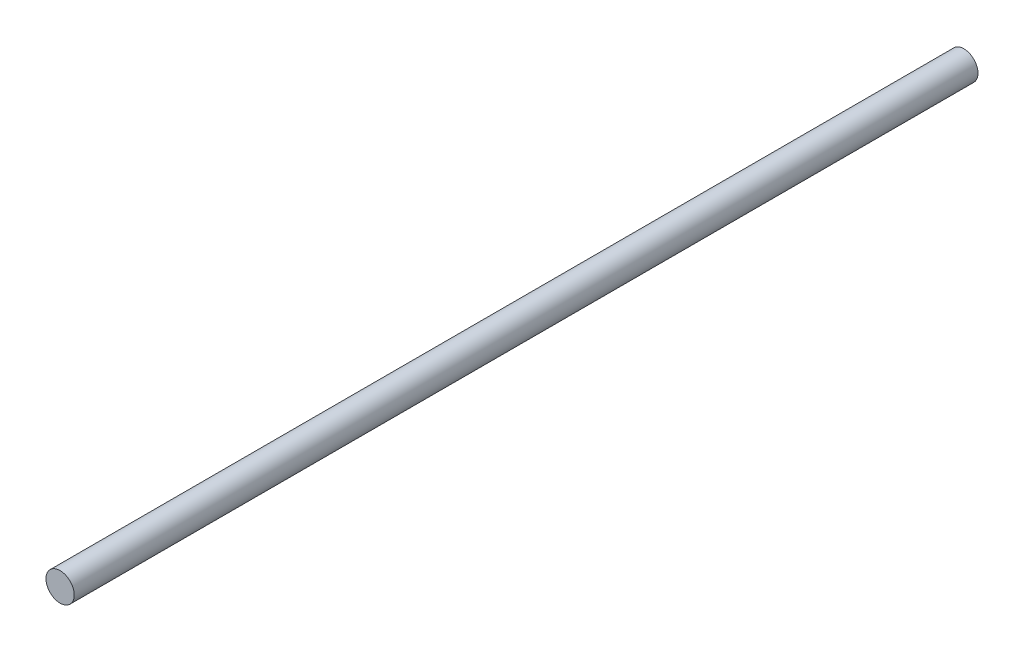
from build123d import *

# Parameters (mm, degrees)
ESQUISSE1_R          = 1.25
BASE_EXTRUSION_DEPTH = 80


with BuildPart() as part:
    # Esquisse1 → Base-Extrusion (new body)
    with BuildSketch(Plane.XY):
        with Locations((24, 27)):
            Circle(ESQUISSE1_R)
    extrude(amount=BASE_EXTRUSION_DEPTH)


solid = part.part
